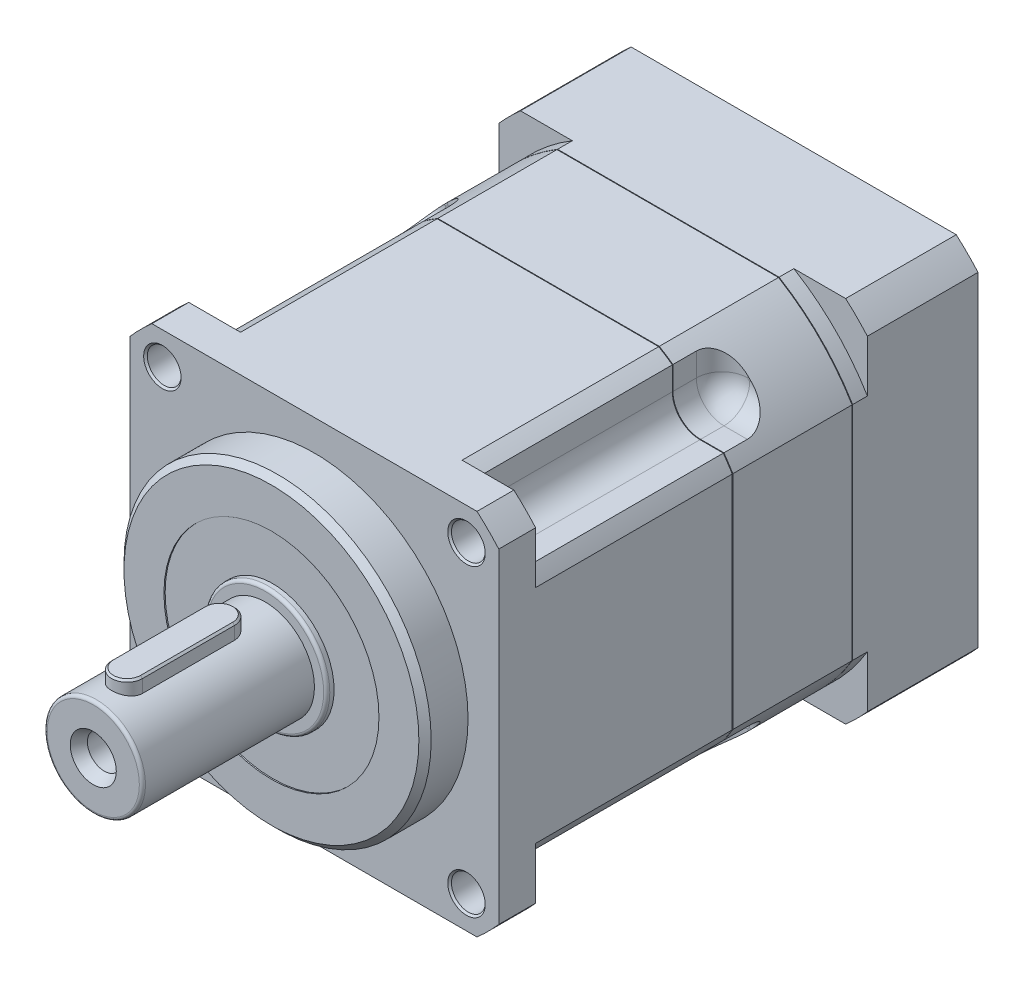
from build123d import *

# Parameters (mm, degrees)
EXTRUDE_1_DEPTH          = 6
SKETCH_2_R               = 25
EXTRUDE_2_DEPTH          = 7
EXTRUDE_3_DEPTH          = 32
SKETCH_4_W               = 13.908632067
SKETCH_4_H               = 13.141259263
CUT_EXTRUDE_1_DEPTH      = 32
PATTERN_CIRCULAR_1_COUNT = 4
FILLET_1_R               = 4.5
SKETCH_5_R               = 2.75
CUT_EXTRUDE_2_DEPTH      = 32
PATTERN_CIRCULAR_2_COUNT = 4
EXTRUDE_4_DEPTH          = 19.4
SKETCH_7_W               = 15.922985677
SKETCH_7_H               = 14.292318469
CUT_EXTRUDE_3_DEPTH      = 8
PATTERN_CIRCULAR_3_COUNT = 4
FILLET_2_R               = 4.5
FILLET_3_R               = 4.2
CHAMFER_1_SIZE           = 1
EXTRUDE_5_DEPTH          = 2.4
EXTRUDE_START            = 18
EXTRUDE_6_DEPTH          = 18
SKETCH_10_R              = 25
CUT_EXTRUDE_4_DEPTH      = 5
SKETCH_11_R              = 4
CUT_EXTRUDE_5_DEPTH      = 12
PATTERN_CIRCULAR_4_COUNT = 4
SKETCH_12_R              = 4
CUT_EXTRUDE_6_DEPTH      = 12
PATTERN_CIRCULAR_5_COUNT = 2
SKETCH_13_R              = 19
CUT_EXTRUDE_7_DEPTH      = 13
SKETCH_14_R              = 3
EXTRUDE_7_DEPTH          = 6
PATTERN_CIRCULAR_6_COUNT = 4
SKETCH_15_R              = 3
EXTRUDE_8_DEPTH          = 6
PATTERN_CIRCULAR_7_COUNT = 2
PATTERN_CIRCULAR_8_COUNT = 4
SKETCH_18_R              = 16.5
EXTRUDE_9_DEPTH          = 11.5
CHAMFER_2_SIZE           = 1
SKETCH_19_R              = 7
CUT_EXTRUDE_8_DEPTH      = 34
SKETCH_20_W              = 35.682835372
SKETCH_20_H              = 1
CUT_EXTRUDE_9_DEPTH      = 11.5
SKETCH_21_R              = 8
EXTRUDE_10_DEPTH         = 29
SKETCH_22_R              = 10
EXTRUDE_11_DEPTH         = 1
FILLET_4_R               = 0.5
FILLET_5_R               = 0.5
CUT_EXTRUDE_START        = -0.2
SKETCH_23_R              = 17.5
SKETCH_23_R_2            = 10
CUT_EXTRUDE_10_DEPTH     = 0.2
EXTRUDE_12_DEPTH         = 10
CHAMFER_3_SIZE           = 0.3
SKETCH_25_R              = 2.75
CUT_EXTRUDE_11_DEPTH     = 4.8
SKETCH_26_R              = 3.75
SKETCH_27_R              = 2.75


with BuildPart() as part:
    # Sketch 1 → Extrude 1 (new body)
    with BuildSketch(Plane.XY):
        with BuildLine():
            Line((-26.457513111, 30), (26.457513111, 30))
            ThreePointArc((26.457513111, 30), (28.284271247, 28.284271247), (30, 26.457513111))
            Line((30, 26.457513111), (30, -26.457513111))
            ThreePointArc((30, -26.457513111), (28.284271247, -28.284271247), (26.457513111, -30))
            Line((26.457513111, -30), (-26.457513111, -30))
            ThreePointArc((-26.457513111, -30), (-28.284271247, -28.284271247), (-30, -26.457513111))
            Line((-30, -26.457513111), (-30, 26.457513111))
            ThreePointArc((-30, 26.457513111), (-28.284271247, 28.284271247), (-26.457513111, 30))
        make_face()
    extrude(amount=EXTRUDE_1_DEPTH)

    # Sketch 2 → Extrude 2 (add)
    with BuildSketch(Plane.XY.offset(6)):
        Circle(SKETCH_2_R)
    extrude(amount=EXTRUDE_2_DEPTH)

    # Sketch 3 → Extrude 3 (add)
    with BuildSketch(Plane(origin=(0, 0, 0), x_dir=(-1, 0, 0), z_dir=(0, 0, -1))):
        with BuildLine():
            Line((-18.027756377, 30), (18.027756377, 30))
            ThreePointArc((18.027756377, 30), (24.748737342, 24.748737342), (30, 18.027756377))
            Line((30, 18.027756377), (30, -18.027756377))
            ThreePointArc((30, -18.027756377), (24.748737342, -24.748737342), (18.027756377, -30))
            Line((18.027756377, -30), (-18.027756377, -30))
            ThreePointArc((-18.027756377, -30), (-24.748737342, -24.748737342), (-30, -18.027756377))
            Line((-30, -18.027756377), (-30, 18.027756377))
            ThreePointArc((-30, 18.027756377), (-24.748737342, 24.748737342), (-18.027756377, 30))
        make_face()
    extrude(amount=EXTRUDE_3_DEPTH)

    # Sketch 4 → Cut-Extrude 1 (cut)
    with BuildSketch(Plane(origin=(0, 0, -32), x_dir=(-1, 0, 0), z_dir=(0, 0, -1))):
        with Locations((-27.204316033, 26.820629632)):
            Rectangle(SKETCH_4_W, SKETCH_4_H)
    cut_extrude_1 = extrude(amount=-CUT_EXTRUDE_1_DEPTH, mode=Mode.SUBTRACT)

    # Pattern Circular 1: Cut-Extrude 1 ×4 about axis
    pattern_circular_1_axis = Axis((0, 0, 0), (0, 0, 1))
    for i in range(1, PATTERN_CIRCULAR_1_COUNT):
        add(cut_extrude_1.rotate(pattern_circular_1_axis, i * 360 / PATTERN_CIRCULAR_1_COUNT), mode=Mode.SUBTRACT)

    # Fillet 1
    fillet_1_edges = [part.edges().sort_by_distance(p)[0] for p in [
        (-20.25, -20.25, -16),
        (20.25, -20.25, -16),
        (20.25, 20.25, -16),
        (-20.25, 20.25, -16),
    ]]
    fillet(fillet_1_edges, radius=FILLET_1_R)

    # Sketch 5 → Cut-Extrude 2 (cut)
    with BuildSketch(Plane.XY.offset(6)):
        with Locations((-24.748737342, 24.748737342)):
            Circle(SKETCH_5_R)
    cut_extrude_2 = extrude(amount=-CUT_EXTRUDE_2_DEPTH, mode=Mode.SUBTRACT)

    # Pattern Circular 2: Cut-Extrude 2 ×4 about axis
    pattern_circular_2_axis = Axis((0, 0, 0), (0, 0, 1))
    for i in range(1, PATTERN_CIRCULAR_2_COUNT):
        add(cut_extrude_2.rotate(pattern_circular_2_axis, i * 360 / PATTERN_CIRCULAR_2_COUNT), mode=Mode.SUBTRACT)

    # Chamfer 1
    chamfer_1_edges = [part.edges().sort_by_distance(p)[0] for p in [
        (-25, 0, 13),
    ]]
    chamfer(chamfer_1_edges, length=CHAMFER_1_SIZE)

    # Sketch 21 → Extrude 10 (add)
    with BuildSketch(Plane.XY.offset(13)):
        with Locations(Location((0, 0, 0), (0, 0, 180))):
            Circle(SKETCH_21_R)
    extrude(amount=EXTRUDE_10_DEPTH)

    # Sketch 22 → Extrude 11 (add)
    with BuildSketch(Plane.XY.offset(13)):
        Circle(SKETCH_22_R)
    extrude(amount=EXTRUDE_11_DEPTH)

    # Fillet 4
    fillet_4_edges = [part.edges().sort_by_distance(p)[0] for p in [
        (-10, 0, 14),
    ]]
    fillet(fillet_4_edges, radius=FILLET_4_R)

    # Fillet 5
    fillet_5_edges = [part.edges().sort_by_distance(p)[0] for p in [
        (8, 0, 42),
    ]]
    fillet(fillet_5_edges, radius=FILLET_5_R)

    # Sketch 23 → Cut-Extrude 10 (cut)
    with BuildSketch(Plane.XY.offset(13).offset(CUT_EXTRUDE_START)):
        Circle(SKETCH_23_R)
        Circle(SKETCH_23_R_2, mode=Mode.SUBTRACT)
    extrude(amount=CUT_EXTRUDE_10_DEPTH, mode=Mode.SUBTRACT)

    # Sketch 24 → Extrude 12 (add)
    with BuildSketch(Plane(origin=(0, 0, 0), x_dir=(1, 0, 0), z_dir=(0, 1, 0))):
        with BuildLine():
            Line((-2.5, -21.5), (-2.5, -36.5))
            ThreePointArc((-2.5, -36.5), (0, -39), (2.5, -36.5))
            Line((2.5, -36.5), (2.5, -21.5))
            ThreePointArc((2.5, -21.5), (0, -19), (-2.5, -21.5))
        make_face()
    extrude(amount=EXTRUDE_12_DEPTH)

    # Chamfer 3
    chamfer_3_edges = [part.edges().sort_by_distance(p)[0] for p in [
        (-27.498737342, 24.748737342, 6),
        (24.748737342, 27.498737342, 6),
        (27.498737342, -24.748737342, 6),
        (-24.748737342, -27.498737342, 6),
        (0, 10, 19),
        (-2.5, 10, 29),
        (0, 10, 39),
        (2.5, 10, 29),
    ]]
    chamfer(chamfer_3_edges, length=CHAMFER_3_SIZE)

    # Sketch 25 → Cut-Extrude 11 (cut)
    with BuildSketch(Plane.XY.offset(42)):
        Circle(SKETCH_25_R)
    extrude(amount=-CUT_EXTRUDE_11_DEPTH, mode=Mode.SUBTRACT)

    # Sketch 26 → Loft 1 section 0
    with BuildSketch(Plane.XY.offset(42)):
        Circle(SKETCH_26_R)
    # Sketch 27 → Loft 1 section 1
    with BuildSketch(Plane.XY.offset(40.2)):
        Circle(SKETCH_27_R)
    loft(mode=Mode.SUBTRACT)

    # Sketch 28 → Hole Wizard M5 _1 (revolve, cut)
    with BuildSketch(Plane(origin=(0, 0, 37.2), x_dir=(0, -1, 0), z_dir=(1, 0, 0))):
        Polygon((0, 0), (0, 20.4618073), (2.1, 19.2), (2.1, 0), align=None)
    revolve(axis=Axis((0, 0, 43.55), (0, 0, -1)), mode=Mode.SUBTRACT)


with BuildPart() as body_2:
    # Sketch 6 → Extrude 4 (new body)
    with BuildSketch(Plane(origin=(0, 0, -32.1), x_dir=(-1, 0, 0), z_dir=(0, 0, -1))):
        with BuildLine():
            Line((-18.027756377, 30), (18.027756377, 30))
            ThreePointArc((18.027756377, 30), (24.748737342, 24.748737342), (30, 18.027756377))
            Line((30, 18.027756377), (30, -18.027756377))
            ThreePointArc((30, -18.027756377), (24.748737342, -24.748737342), (18.027756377, -30))
            Line((18.027756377, -30), (-18.027756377, -30))
            ThreePointArc((-18.027756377, -30), (-24.748737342, -24.748737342), (-30, -18.027756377))
            Line((-30, -18.027756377), (-30, 18.027756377))
            ThreePointArc((-30, 18.027756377), (-24.748737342, 24.748737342), (-18.027756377, 30))
        make_face()
    extrude(amount=EXTRUDE_4_DEPTH)

    # Sketch 7 → Cut-Extrude 3 (cut)
    with BuildSketch(Plane.XY.offset(-32.1)):
        with Locations((-28.211492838, 27.396159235)):
            Rectangle(SKETCH_7_W, SKETCH_7_H)
    cut_extrude_3 = extrude(amount=-CUT_EXTRUDE_3_DEPTH, mode=Mode.SUBTRACT)

    # Pattern Circular 3: Cut-Extrude 3 ×4 about axis
    pattern_circular_3_axis = Axis((0, 0, 0), (0, 0, 1))
    for i in range(1, PATTERN_CIRCULAR_3_COUNT):
        add(cut_extrude_3.rotate(pattern_circular_3_axis, i * 360 / PATTERN_CIRCULAR_3_COUNT), mode=Mode.SUBTRACT)

    # Fillet 2
    fillet_2_edges = [body_2.edges().sort_by_distance(p)[0] for p in [
        (-20.25, 20.25, -36.1),
        (-20.25, -20.25, -36.1),
        (20.25, -20.25, -36.1),
        (20.25, 20.25, -36.1),
    ]]
    fillet(fillet_2_edges, radius=FILLET_2_R)

    # Fillet 3
    fillet_3_edges = [body_2.edges().sort_by_distance(p)[0] for p in [
        (21.568019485, 21.568019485, -40.1),
        (-20.25, 26.648555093, -40.1),
        (-21.568019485, 21.568019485, -40.1),
        (-26.648555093, 20.25, -40.1),
        (-20.25, -26.648555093, -40.1),
        (26.648555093, -20.25, -40.1),
        (20.25, 26.648555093, -40.1),
        (-26.648555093, -20.25, -40.1),
        (-21.568019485, -21.568019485, -40.1),
        (20.25, -26.648555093, -40.1),
        (21.568019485, -21.568019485, -40.1),
        (26.648555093, 20.25, -40.1),
    ]]
    fillet(fillet_3_edges, radius=FILLET_3_R)


with BuildPart() as body_3:
    # Sketch 8 → Extrude 5 (new body)
    with BuildSketch(Plane(origin=(0, 0, -51.6), x_dir=(-1, 0, 0), z_dir=(0, 0, -1))):
        with BuildLine():
            Line((18.027756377, 30), (-18.027756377, 30))
            ThreePointArc((-18.027756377, 30), (-24.748737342, 24.748737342), (-30, 18.027756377))
            Line((-30, 18.027756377), (-30, -18.027756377))
            ThreePointArc((-30, -18.027756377), (-24.748737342, -24.748737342), (-18.027756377, -30))
            Line((-18.027756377, -30), (18.027756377, -30))
            ThreePointArc((18.027756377, -30), (24.748737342, -24.748737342), (30, -18.027756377))
            Line((30, -18.027756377), (30, 18.027756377))
            ThreePointArc((30, 18.027756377), (24.748737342, 24.748737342), (18.027756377, 30))
        make_face()
    extrude(amount=EXTRUDE_5_DEPTH)

    # Sketch 9 → Extrude 6 (add)
    with BuildSketch(Plane(origin=(0, 0, -54), x_dir=(-1, 0, 0), z_dir=(0, 0, -1)).offset(EXTRUDE_START)):
        with BuildLine():
            Line((-26.457513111, 30), (26.457513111, 30))
            ThreePointArc((26.457513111, 30), (28.284271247, 28.284271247), (30, 26.457513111))
            Line((30, 26.457513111), (30, -26.457513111))
            ThreePointArc((30, -26.457513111), (28.284271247, -28.284271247), (26.457513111, -30))
            Line((26.457513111, -30), (-26.457513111, -30))
            ThreePointArc((-26.457513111, -30), (-28.284271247, -28.284271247), (-30, -26.457513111))
            Line((-30, -26.457513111), (-30, 26.457513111))
            ThreePointArc((-30, 26.457513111), (-28.284271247, 28.284271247), (-26.457513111, 30))
        make_face()
    extrude(amount=-EXTRUDE_6_DEPTH)

    # Sketch 10 → Cut-Extrude 4 (cut)
    with BuildSketch(Plane(origin=(0, 0, -72), x_dir=(-1, 0, 0), z_dir=(0, 0, -1))):
        Circle(SKETCH_10_R)
    extrude(amount=-CUT_EXTRUDE_4_DEPTH, mode=Mode.SUBTRACT)

    # Sketch 11 → Cut-Extrude 5 (cut)
    with BuildSketch(Plane(origin=(0, 0, -72), x_dir=(-1, 0, 0), z_dir=(0, 0, -1))):
        with Locations((6.470476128, -24.148145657)):
            Circle(SKETCH_11_R)
    cut_extrude_5 = extrude(amount=-CUT_EXTRUDE_5_DEPTH, mode=Mode.SUBTRACT)

    # Pattern Circular 4: Cut-Extrude 5 ×4 about axis
    pattern_circular_4_axis = Axis((0, 0, 0), (0, 0, 1))
    for i in range(1, PATTERN_CIRCULAR_4_COUNT):
        add(cut_extrude_5.rotate(pattern_circular_4_axis, i * 360 / PATTERN_CIRCULAR_4_COUNT), mode=Mode.SUBTRACT)

    # Sketch 12 → Cut-Extrude 6 (cut)
    with BuildSketch(Plane(origin=(0, 0, -72), x_dir=(-1, 0, 0), z_dir=(0, 0, -1))):
        with Locations((-15.733009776, -19.428649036)):
            Circle(SKETCH_12_R)
    cut_extrude_6 = extrude(amount=-CUT_EXTRUDE_6_DEPTH, mode=Mode.SUBTRACT)

    # Pattern Circular 5: Cut-Extrude 6 ×2 about axis
    pattern_circular_5_axis = Axis((0, 0, 0), (0, 0, 1))
    for i in range(1, PATTERN_CIRCULAR_5_COUNT):
        add(cut_extrude_6.rotate(pattern_circular_5_axis, i * 360 / PATTERN_CIRCULAR_5_COUNT), mode=Mode.SUBTRACT)

    # Sketch 13 → Cut-Extrude 7 (cut)
    with BuildSketch(Plane(origin=(0, 0, -67), x_dir=(-1, 0, 0), z_dir=(0, 0, -1))):
        Circle(SKETCH_13_R)
    extrude(amount=-CUT_EXTRUDE_7_DEPTH, mode=Mode.SUBTRACT)

    # Sketch 14 → Extrude 7 (add)
    with BuildSketch(Plane(origin=(0, 0, -60), x_dir=(-1, 0, 0), z_dir=(0, 0, -1))):
        with Locations((-6.470476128, 24.148145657)):
            Circle(SKETCH_14_R)
        Polygon((-5.6436782, 25.788974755), (-7.478076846, 25.684588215), (-8.304874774, 24.043759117), (-7.297274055, 22.507316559), (-5.462875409, 22.611703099), (-4.636077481, 24.252532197), align=None, mode=Mode.SUBTRACT)
    extrude_7 = extrude(amount=EXTRUDE_7_DEPTH)

    # Pattern Circular 6: Extrude 7 ×4 about axis
    pattern_circular_6_axis = Axis((0, 0, 0), (0, 0, 1))
    for i in range(1, PATTERN_CIRCULAR_6_COUNT):
        add(extrude_7.rotate(pattern_circular_6_axis, i * 360 / PATTERN_CIRCULAR_6_COUNT))

    # Sketch 15 → Extrude 8 (add)
    with BuildSketch(Plane(origin=(0, 0, -60), x_dir=(-1, 0, 0), z_dir=(0, 0, -1))):
        with Locations((-15.733009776, -19.428649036)):
            Circle(SKETCH_15_R)
        Polygon((-14.815671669, -17.876419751), (-16.618610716, -17.858096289), (-17.535948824, -19.410325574), (-16.650347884, -20.980878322), (-14.847408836, -20.999201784), (-13.930070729, -19.446972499), align=None, mode=Mode.SUBTRACT)
    extrude_8 = extrude(amount=EXTRUDE_8_DEPTH)

    # Pattern Circular 7: Extrude 8 ×2 about axis
    pattern_circular_7_axis = Axis((0, 0, 0), (0, 0, 1))
    for i in range(1, PATTERN_CIRCULAR_7_COUNT):
        add(extrude_8.rotate(pattern_circular_7_axis, i * 360 / PATTERN_CIRCULAR_7_COUNT))

    # Sketch 17 → Hole Wizard M4 _1 (revolve, cut)
    with BuildSketch(Plane(origin=(24.748737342, 24.748737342, -72), x_dir=(0, 1, 0), z_dir=(1, 0, 0))):
        Polygon((0, 0), (0, 16.491420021), (1.65, 15.5), (1.65, 0), align=None)
    hole_wizard_m4_1 = revolve(axis=Axis((24.748737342, 24.748737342, -78.35), (0, 0, 1)), mode=Mode.SUBTRACT)

    # Pattern Circular 8: Hole Wizard M4 _1 ×4 about axis
    pattern_circular_8_axis = Axis((0, 0, 0), (0, 0, 1))
    for i in range(1, PATTERN_CIRCULAR_8_COUNT):
        add(hole_wizard_m4_1.rotate(pattern_circular_8_axis, i * 360 / PATTERN_CIRCULAR_8_COUNT), mode=Mode.SUBTRACT)

    # Sketch 18 → Extrude 9 (add)
    with BuildSketch(Plane(origin=(0, 0, -54), x_dir=(-1, 0, 0), z_dir=(0, 0, -1))):
        Circle(SKETCH_18_R)
    extrude(amount=EXTRUDE_9_DEPTH)

    # Chamfer 2
    chamfer_2_edges = [body_3.edges().sort_by_distance(p)[0] for p in [
        (16.5, 0, -65.5),
    ]]
    chamfer(chamfer_2_edges, length=CHAMFER_2_SIZE)


with BuildPart() as cut_extrude_8_tool:
    # Sketch 19 → Cut-Extrude 8 (new body)
    with BuildSketch(Plane(origin=(0, 0, -72), x_dir=(-1, 0, 0), z_dir=(0, 0, -1))):
        Circle(SKETCH_19_R)
    extrude(amount=-CUT_EXTRUDE_8_DEPTH)


with BuildPart() as body_2_1:
    add(body_2.part)

    # Cut-Extrude 8: cut by cut_extrude_8_tool
    add(cut_extrude_8_tool.part, mode=Mode.SUBTRACT)


with BuildPart() as body_3_1:
    add(body_3.part)

    # Cut-Extrude 8: cut by cut_extrude_8_tool
    add(cut_extrude_8_tool.part, mode=Mode.SUBTRACT)

    # Sketch 20 → Cut-Extrude 9 (cut)
    with BuildSketch(Plane(origin=(0, 0, -65.5), x_dir=(-1, 0, 0), z_dir=(0, 0, -1))):
        with Locations((0.383686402, 0)):
            Rectangle(SKETCH_20_W, SKETCH_20_H)
    extrude(amount=-CUT_EXTRUDE_9_DEPTH, mode=Mode.SUBTRACT)


solid = Compound([part.part, body_2_1.part, body_3_1.part])
